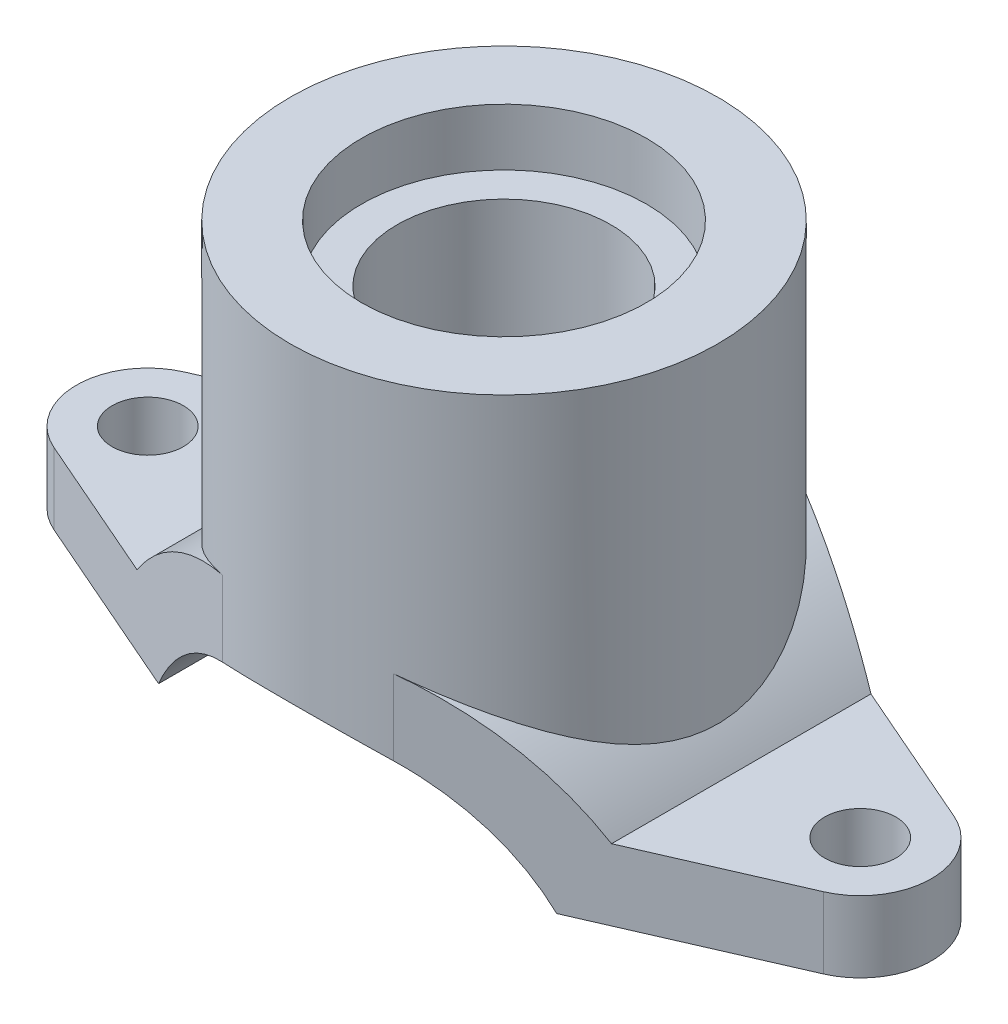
from build123d import *

# Parameters (mm, degrees)
EXTRUDE1_DEPTH    = 75
SKETCH2_OUTSIDE_W = 370.368
SKETCH2_OUTSIDE_H = 220.368
EXTRUDE2_DEPTH    = 223.162102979
EXTRUDE3_REACH    = 227
SKETCH3_R         = 75
SKETCH6_R         = 12.5
EXTRUDE4_DEPTH    = 210.165006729


with BuildPart() as part:
    # Sketch1 → Extrude1 (new, symmetric)
    with BuildSketch(Plane.XY):
        with BuildLine():
            Line((-69.84983894, 0), (-150, 0))
            Line((-150, 0), (-150, 25))
            Line((-150, 25), (-83.240615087, 25))
            ThreePointArc((-83.240615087, 25), (0, 66), (83.240615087, 25))
            Line((83.240615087, 25), (150, 25))
            Line((150, 25), (150, 0))
            Line((150, 0), (69.84983894, 0))
            ThreePointArc((69.84983894, 0), (0, 41), (-69.84983894, 0))
        make_face()
    extrude(amount=EXTRUDE1_DEPTH, both=True)

    # Sketch2 outside → Extrude2 (cut, through all)
    with BuildSketch(Plane(origin=(0, 66, 75), x_dir=(-1, 0, 0), z_dir=(0, 1, 0))):
        with Locations((0, -75)):
            Rectangle(SKETCH2_OUTSIDE_W, SKETCH2_OUTSIDE_H)
        with BuildLine():
            Line((-135, -52.087121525), (-30, -6.261364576))
            ThreePointArc((-30, -6.261364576), (0, 0), (30, -6.261364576))
            Line((30, -6.261364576), (135, -52.087121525))
            ThreePointArc((135, -52.087121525), (150, -75), (135, -97.912878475))
            Line((135, -97.912878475), (30, -143.738635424))
            ThreePointArc((30, -143.738635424), (0, -150), (-30, -143.738635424))
            Line((-30, -143.738635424), (-135, -97.912878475))
            ThreePointArc((-135, -97.912878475), (-150, -75), (-135, -52.087121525))
        make_face(mode=Mode.SUBTRACT)
    extrude(amount=-EXTRUDE2_DEPTH, mode=Mode.SUBTRACT)

    # Sketch3 → Extrude3 (add, up to next)
    with BuildSketch(Plane(origin=(0, 150, 0), x_dir=(-1, 0, 0), z_dir=(0, 1, 0)), mode=Mode.PRIVATE) as extrude3_sk1:
        with Locations(Location((0, 0, 0), (0, 0, 293.578178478))):
            Circle(SKETCH3_R)
    extrude3_tool1 = extrude(extrude3_sk1.sketch, amount=-EXTRUDE3_REACH, mode=Mode.PRIVATE) - part.part
    add(extrude3_tool1.solids().sort_by_distance((0, 150, 0))[0])

    # Sketch4 → Cut-Revolve1 (revolve, cut)
    with BuildSketch(Plane.XY, mode=Mode.PRIVATE) as cut_revolve1_sk:
        Polygon((0, 0), (0, 150), (50, 150), (50, 130), (37.5, 130), (37.5, 0), align=None)
    revolve(cut_revolve1_sk.sketch.rotate(Axis((0, 186.176784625, 0), (0, -1, 0)), 90), axis=Axis((0, 186.176784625, 0), (0, -1, 0)), mode=Mode.SUBTRACT)

    # Sketch6 → Extrude4 (cut, through all)
    with BuildSketch(Plane(origin=(0, 25, 0), x_dir=(1, 0, 0), z_dir=(0, 1, 0))):
        with Locations(Location((-125, 0, 0), (0, 0, 180))):
            Circle(SKETCH6_R)
        with Locations(Location((125, 0, 0), (0, 0, 180))):
            Circle(SKETCH6_R)
    extrude(amount=-EXTRUDE4_DEPTH, mode=Mode.SUBTRACT)


solid = part.part
